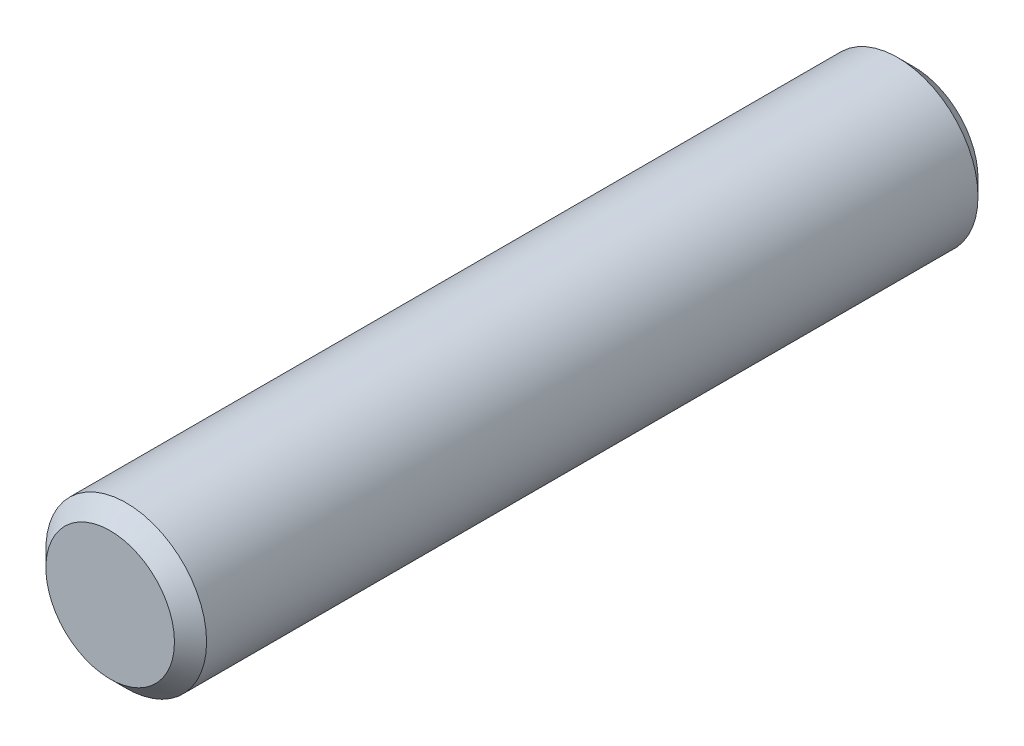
ISO-10303-21;
HEADER;
FILE_DESCRIPTION(('STEP AP214'),'2;1');
FILE_NAME('part.step','',(''),(''),'','','');
FILE_SCHEMA(('AUTOMOTIVE_DESIGN { 1 0 10303 214 1 1 1 1 }'));
ENDSEC;
DATA;
#1=APPLICATION_CONTEXT('core data for automotive mechanical design processes');
#2=APPLICATION_PROTOCOL_DEFINITION('international standard','automotive_design',2000,#1);
#3=PRODUCT_CONTEXT('',#1,'mechanical');
#4=PRODUCT('Part','Part','',(#3));
#5=PRODUCT_RELATED_PRODUCT_CATEGORY('part','',(#4));
#6=PRODUCT_DEFINITION_FORMATION('','',#4);
#7=PRODUCT_DEFINITION_CONTEXT('part definition',#1,'design');
#8=PRODUCT_DEFINITION('design','',#6,#7);
#9=PRODUCT_DEFINITION_SHAPE('','',#8);
#10=(LENGTH_UNIT() NAMED_UNIT(*) SI_UNIT(.MILLI.,.METRE.));
#11=(NAMED_UNIT(*) PLANE_ANGLE_UNIT() SI_UNIT($,.RADIAN.));
#12=(NAMED_UNIT(*) SI_UNIT($,.STERADIAN.) SOLID_ANGLE_UNIT());
#13=UNCERTAINTY_MEASURE_WITH_UNIT(LENGTH_MEASURE(1.E-05),#10,'distance_accuracy_value','');
#14=(GEOMETRIC_REPRESENTATION_CONTEXT(3) GLOBAL_UNCERTAINTY_ASSIGNED_CONTEXT((#13)) GLOBAL_UNIT_ASSIGNED_CONTEXT((#10,
#11,#12)) REPRESENTATION_CONTEXT('',''));
#15=CARTESIAN_POINT('',(0.,0.,0.));
#16=DIRECTION('',(0.,0.,1.));
#17=DIRECTION('',(1.,0.,0.));
#18=AXIS2_PLACEMENT_3D('',#15,#16,#17);
#19=CARTESIAN_POINT('',(0.,0.,100.));
#20=DIRECTION('',(0.,0.,-1.));
#21=DIRECTION('',(-1.,0.,0.));
#22=AXIS2_PLACEMENT_3D('',#19,#20,#21);
#23=CYLINDRICAL_SURFACE('',#22,10.);
#24=CARTESIAN_POINT('',(0.,0.,2.));
#25=DIRECTION('',(0.,0.,1.));
#26=DIRECTION('',(1.,0.,0.));
#27=AXIS2_PLACEMENT_3D('',#24,#25,#26);
#28=CIRCLE('',#27,10.);
#29=CARTESIAN_POINT('',(10.,0.,2.));
#30=VERTEX_POINT('',#29);
#31=EDGE_CURVE('E37',#30,#30,#28,.T.);
#32=ORIENTED_EDGE('',*,*,#31,.T.);
#33=EDGE_LOOP('',(#32));
#34=FACE_BOUND('',#33,.T.);
#35=CARTESIAN_POINT('',(0.,0.,98.));
#36=DIRECTION('',(0.,0.,1.));
#37=DIRECTION('',(1.,0.,0.));
#38=AXIS2_PLACEMENT_3D('',#35,#36,#37);
#39=CIRCLE('',#38,10.);
#40=CARTESIAN_POINT('',(10.,0.,98.));
#41=VERTEX_POINT('',#40);
#42=EDGE_CURVE('E41',#41,#41,#39,.F.);
#43=ORIENTED_EDGE('',*,*,#42,.T.);
#44=EDGE_LOOP('',(#43));
#45=FACE_BOUND('',#44,.T.);
#46=ADVANCED_FACE('F27',(#34,#45),#23,.T.);
#47=CARTESIAN_POINT('',(0.,0.,100.));
#48=DIRECTION('',(0.,0.,1.));
#49=DIRECTION('',(1.,0.,0.));
#50=AXIS2_PLACEMENT_3D('',#47,#48,#49);
#51=PLANE('',#50);
#52=CARTESIAN_POINT('',(0.,0.,100.));
#53=DIRECTION('',(0.,0.,1.));
#54=DIRECTION('',(1.,0.,0.));
#55=AXIS2_PLACEMENT_3D('',#52,#53,#54);
#56=CIRCLE('',#55,8.);
#57=CARTESIAN_POINT('',(8.,0.,100.));
#58=VERTEX_POINT('',#57);
#59=EDGE_CURVE('E10',#58,#58,#56,.T.);
#60=ORIENTED_EDGE('',*,*,#59,.T.);
#61=EDGE_LOOP('',(#60));
#62=FACE_BOUND('',#61,.T.);
#63=ADVANCED_FACE('F60',(#62),#51,.T.);
#64=CARTESIAN_POINT('',(0.,0.,0.));
#65=DIRECTION('',(0.,0.,1.));
#66=DIRECTION('',(1.,0.,0.));
#67=AXIS2_PLACEMENT_3D('',#64,#65,#66);
#68=PLANE('',#67);
#69=CARTESIAN_POINT('',(0.,0.,0.));
#70=DIRECTION('',(0.,0.,1.));
#71=DIRECTION('',(1.,0.,0.));
#72=AXIS2_PLACEMENT_3D('',#69,#70,#71);
#73=CIRCLE('',#72,7.99999999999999);
#74=CARTESIAN_POINT('',(7.99999999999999,0.,0.));
#75=VERTEX_POINT('',#74);
#76=EDGE_CURVE('E33',#75,#75,#73,.F.);
#77=ORIENTED_EDGE('',*,*,#76,.T.);
#78=EDGE_LOOP('',(#77));
#79=FACE_BOUND('',#78,.T.);
#80=ADVANCED_FACE('F56',(#79),#68,.F.);
#81=CARTESIAN_POINT('',(0.,0.,2.));
#82=DIRECTION('',(0.,0.,1.));
#83=DIRECTION('',(1.,0.,0.));
#84=AXIS2_PLACEMENT_3D('',#81,#82,#83);
#85=CONICAL_SURFACE('',#84,10.,0.78539816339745);
#86=ORIENTED_EDGE('',*,*,#76,.F.);
#87=EDGE_LOOP('',(#86));
#88=FACE_BOUND('',#87,.T.);
#89=ORIENTED_EDGE('',*,*,#31,.F.);
#90=EDGE_LOOP('',(#89));
#91=FACE_BOUND('',#90,.T.);
#92=ADVANCED_FACE('F51',(#88,#91),#85,.T.);
#93=CARTESIAN_POINT('',(0.,0.,100.));
#94=DIRECTION('',(0.,0.,-1.));
#95=DIRECTION('',(-1.,0.,0.));
#96=AXIS2_PLACEMENT_3D('',#93,#94,#95);
#97=CONICAL_SURFACE('',#96,8.,0.785398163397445);
#98=ORIENTED_EDGE('',*,*,#42,.F.);
#99=EDGE_LOOP('',(#98));
#100=FACE_BOUND('',#99,.T.);
#101=ORIENTED_EDGE('',*,*,#59,.F.);
#102=EDGE_LOOP('',(#101));
#103=FACE_BOUND('',#102,.T.);
#104=ADVANCED_FACE('F48',(#100,#103),#97,.T.);
#105=CLOSED_SHELL('',(#46,#63,#80,#92,#104));
#106=MANIFOLD_SOLID_BREP('B2',#105);
#107=ADVANCED_BREP_SHAPE_REPRESENTATION('',(#18,#106),#14);
#108=SHAPE_DEFINITION_REPRESENTATION(#9,#107);
ENDSEC;
END-ISO-10303-21;
